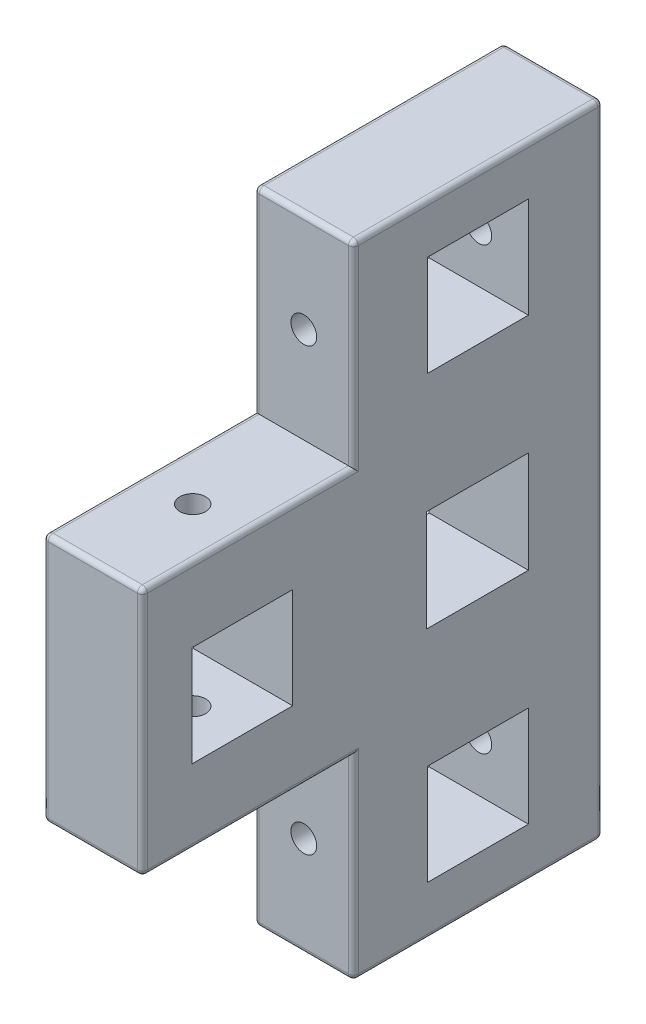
from build123d import *

# Parameters (mm, degrees)
EXTRUDE_1_DEPTH     = 10
SKETCH_2_W          = 20.3
SKETCH_2_H          = 20.3
SKETCH_2_W_2        = 20.5
SKETCH_2_H_2        = 20.5
CUT_EXTRUDE_1_DEPTH = 90.219247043
SKETCH_3_R          = 2.6
CUT_EXTRUDE_2_DEPTH = 119.29548911
SKETCH_4_R          = 2.6
CUT_EXTRUDE_3_DEPTH = 103.188239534
FILLET_2_R          = 1


with BuildPart() as part:
    # Sketch 1 → Extrude 1 (new, symmetric)
    with BuildSketch(Plane.YZ):
        Polygon((-56.586638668, 2.473503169), (-56.586638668, -47.826496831), (72.613361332, -47.826496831), (72.613361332, 2.473503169), (33.163361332, 2.473503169), (33.163361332, 45.023503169), (-17.136638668, 45.023503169), (-17.136638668, 2.473503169), align=None)
    extrude(amount=EXTRUDE_1_DEPTH, both=True)

    # Sketch 2 → Cut-Extrude 1 (cut, through all)
    with BuildSketch(Plane.YZ.offset(10)):
        with Locations((8.013361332, 24.873503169)):
            Rectangle(SKETCH_2_W, SKETCH_2_H)
        with Locations((8.013361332, -22.576496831)):
            Rectangle(SKETCH_2_W_2, SKETCH_2_H_2)
        with Locations((-36.436638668, -22.676496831)):
            Rectangle(SKETCH_2_W, SKETCH_2_H)
        with Locations((52.463361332, -22.676496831)):
            Rectangle(SKETCH_2_W, SKETCH_2_H)
    extrude(amount=-CUT_EXTRUDE_1_DEPTH, mode=Mode.SUBTRACT)

    # Sketch 3 → Cut-Extrude 2 (cut, through all)
    with BuildSketch(Plane(origin=(0, 0, -47.826496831), x_dir=(1, 0, 0), z_dir=(0, 0, -1))):
        with Locations(Location((0, 36.436638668, 0), (0, 0, 270))):
            Circle(SKETCH_3_R)
        with Locations(Location((0, -52.463361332, 0), (0, 0, 270))):
            Circle(SKETCH_3_R)
    extrude(amount=-CUT_EXTRUDE_2_DEPTH, mode=Mode.SUBTRACT)

    # Sketch 4 → Cut-Extrude 3 (cut, through all)
    with BuildSketch(Plane.XZ.offset(17.136638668)):
        with Locations(Location((0, 24.873503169, 0), (0, 0, 270))):
            Circle(SKETCH_4_R)
    extrude(amount=-CUT_EXTRUDE_3_DEPTH, mode=Mode.SUBTRACT)

    # Fillet 2
    fillet_2_edges = [part.edges().sort_by_distance(p)[0] for p in [
        (-10, 72.613361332, -22.676496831),
        (-10, 8.013361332, -47.826496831),
        (-10, -56.586638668, -22.676496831),
        (-10, -36.861638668, 2.473503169),
        (10, 8.013361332, -47.826496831),
        (0, -17.136638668, 45.023503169),
        (0, 33.163361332, 45.023503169),
        (0, 72.613361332, 2.473503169),
        (0, 72.613361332, -47.826496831),
        (0, -56.586638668, -47.826496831),
        (0, -56.586638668, 2.473503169),
        (10, 72.613361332, -22.676496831),
        (10, 52.888361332, 2.473503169),
        (10, 33.163361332, 23.748503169),
        (10, 8.013361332, 45.023503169),
        (10, -17.136638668, 23.748503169),
        (10, -36.861638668, 2.473503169),
        (-10, -17.136638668, 23.748503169),
        (10, -56.586638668, -22.676496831),
        (-10, 8.013361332, 45.023503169),
        (-10, 33.163361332, 23.748503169),
        (-10, 52.888361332, 2.473503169),
    ]]
    fillet(fillet_2_edges, radius=FILLET_2_R)


solid = part.part
